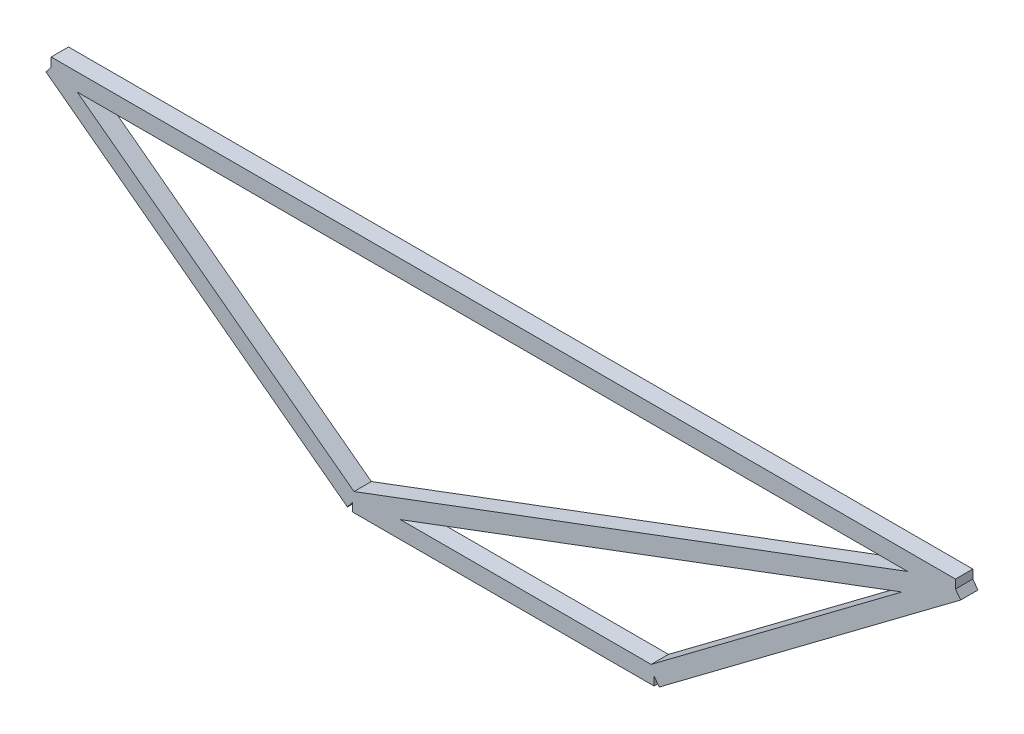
from build123d import *

# Parameters (mm, degrees)
SKETCH1_W           = 1200
SKETCH1_H           = 23
BOSS_EXTRUDE1_DEPTH = 23
BOSS_EXTRUDE2_DEPTH = 23
SKETCH3_W           = 400
SKETCH3_H           = 23
BOSS_EXTRUDE3_DEPTH = 23
BOSS_EXTRUDE4_DEPTH = 23
BOSS_EXTRUDE5_DEPTH = 23


with BuildPart() as part:
    # Sketch1 → Boss-Extrude1 (new body)
    with BuildSketch(Plane.XY):
        with Locations((600, 0)):
            Rectangle(SKETCH1_W, SKETCH1_H)
    extrude(amount=BOSS_EXTRUDE1_DEPTH)

    # Sketch2 → Boss-Extrude2 (add)
    with BuildSketch(Plane.XY):
        Polygon((6.9, 9.2), (406.9, -290.8), (393.1, -309.2), (-6.9, -9.2), align=None)
    extrude(amount=BOSS_EXTRUDE2_DEPTH)

    # Sketch3 → Boss-Extrude3 (add)
    with BuildSketch(Plane.XY):
        with Locations((600, -300)):
            Rectangle(SKETCH3_W, SKETCH3_H)
    extrude(amount=BOSS_EXTRUDE3_DEPTH)

    # Sketch4 → Boss-Extrude4 (add)
    with BuildSketch(Plane.XY):
        Polygon((793.1, -290.8), (1193.1, 9.2), (1206.9, -9.2), (806.9, -309.2), align=None)
    extrude(amount=BOSS_EXTRUDE4_DEPTH)

    # Sketch5 → Boss-Extrude5 (add)
    with BuildSketch(Plane.XY):
        Polygon((1204.037919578, -10.767785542), (404.037919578, -310.767785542), (395.962080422, -289.232214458), (1195.962080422, 10.767785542), align=None)
    extrude(amount=BOSS_EXTRUDE5_DEPTH)


solid = part.part
